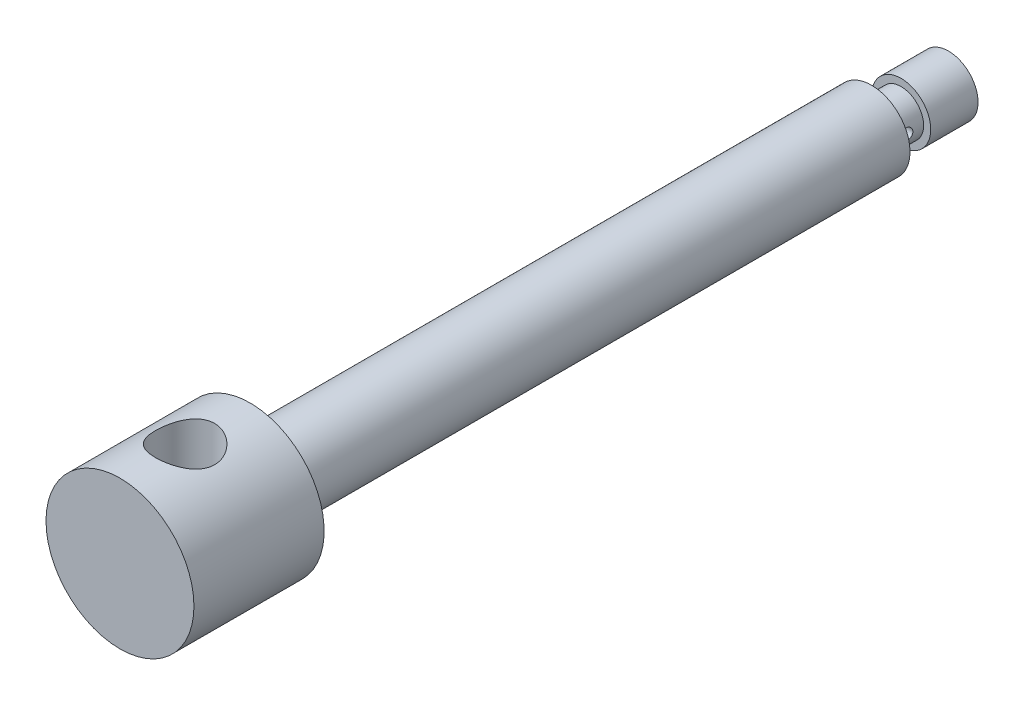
from build123d import *

# Parameters (mm, degrees)
SKETCH1_R                           = 12.5
BOSS_EXTRUDE1_DEPTH                 = 140
CUT_EXTRUDE1_REACH                  = 143.112
CUT_EXTRUDE1_END_RADIUS             = 12.5
SKETCH3_R                           = 5
CUT_EXTRUDE1_DIRECTION_2_REACH      = 143.112
CUT_EXTRUDE1_DIRECTION_2_END_RADIUS = 12.5
SKETCH4_R                           = 1
CUT_EXTRUDE2_DEPTH                  = 5


with BuildPart() as part:
    # Sketch1 → Boss-Extrude1 (new body)
    with BuildSketch(Plane.XY):
        Circle(SKETCH1_R)
    extrude(amount=BOSS_EXTRUDE1_DEPTH)

    # Sketch2 → Cut-Revolve2 (revolve, cut)
    with BuildSketch(Plane(origin=(0, 0, 0), x_dir=(1, 0, 0), z_dir=(0, 1, 0)), mode=Mode.PRIVATE) as cut_revolve2_sk:
        Polygon((5, 0), (5, -8), (3.8, -8), (3.8, -13), (6.5, -13), (6.5, -115), (3.8, -115), (3.8, -118), (14.479111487, -118), (14.479111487, 0), align=None)
    revolve(cut_revolve2_sk.sketch.rotate(Axis((0, 0, 0), (0, 0, 1)), 180), axis=Axis((0, 0, 0), (0, 0, 1)), mode=Mode.SUBTRACT)

    # Cut-Extrude1: up to this cylinder (the profile starts inside it)
    cut_extrude1_end = Plane(origin=(0, 0, 129), z_dir=(0, 0, -1)) * Cylinder(CUT_EXTRUDE1_END_RADIUS, 312.224, mode=Mode.PRIVATE)
    # Sketch3 → Cut-Extrude1 (cut, up to the surface)
    with BuildSketch(Plane(origin=(0, 0, 0), x_dir=(1, 0, 0), z_dir=(0, 1, 0)), mode=Mode.PRIVATE) as cut_extrude1_sk1:
        with Locations(Location((0, -129, 0), (0, 0, 270))):
            Circle(SKETCH3_R)
    cut_extrude1_tool1 = extrude(cut_extrude1_sk1.sketch, amount=-CUT_EXTRUDE1_REACH, mode=Mode.PRIVATE) & cut_extrude1_end
    add(cut_extrude1_tool1.solids().sort_by_distance((0, 0, 129))[0], mode=Mode.SUBTRACT)

    # Cut-Extrude1 direction 2: up to this cylinder (the profile starts inside it)
    cut_extrude1_direction_2_end = Plane(origin=(0, 0, 129), z_dir=(0, 0, -1)) * Cylinder(CUT_EXTRUDE1_DIRECTION_2_END_RADIUS, 312.224, mode=Mode.PRIVATE)
    # Sketch3 → Cut-Extrude1 direction 2 (cut, up to the surface)
    with BuildSketch(Plane(origin=(0, 0, 0), x_dir=(1, 0, 0), z_dir=(0, 1, 0)), mode=Mode.PRIVATE) as cut_extrude1_direction_2_sk1:
        with Locations(Location((0, -129, 0), (0, 0, 270))):
            Circle(SKETCH3_R)
    cut_extrude1_direction_2_tool1 = extrude(cut_extrude1_direction_2_sk1.sketch, amount=CUT_EXTRUDE1_DIRECTION_2_REACH, mode=Mode.PRIVATE) & cut_extrude1_direction_2_end
    add(cut_extrude1_direction_2_tool1.solids().sort_by_distance((0, 0, 129))[0], mode=Mode.SUBTRACT)

    # Sketch4 → Cut-Extrude2 (cut, symmetric)
    with BuildSketch(Plane(origin=(0, 0, 0), x_dir=(0, 0, -1), z_dir=(1, 0, 0))):
        with Locations((-10.81, 0)):
            Circle(SKETCH4_R)
    extrude(amount=CUT_EXTRUDE2_DEPTH, both=True, mode=Mode.SUBTRACT)


solid = part.part
